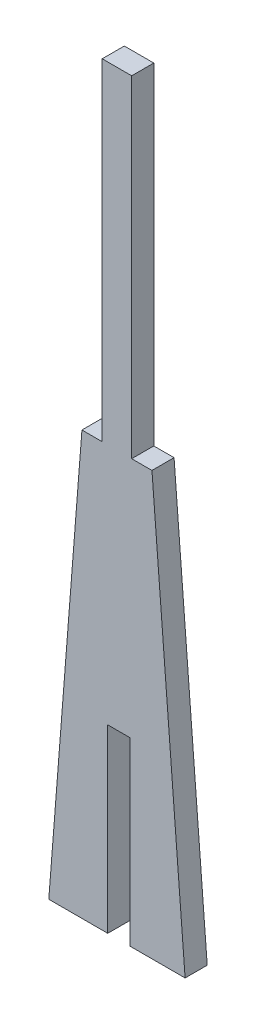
ISO-10303-21;
HEADER;
FILE_DESCRIPTION(('STEP AP214'),'2;1');
FILE_NAME('part.step','',(''),(''),'','','');
FILE_SCHEMA(('AUTOMOTIVE_DESIGN { 1 0 10303 214 1 1 1 1 }'));
ENDSEC;
DATA;
#1=APPLICATION_CONTEXT('core data for automotive mechanical design processes');
#2=APPLICATION_PROTOCOL_DEFINITION('international standard','automotive_design',2000,#1);
#3=PRODUCT_CONTEXT('',#1,'mechanical');
#4=PRODUCT('Part','Part','',(#3));
#5=PRODUCT_RELATED_PRODUCT_CATEGORY('part','',(#4));
#6=PRODUCT_DEFINITION_FORMATION('','',#4);
#7=PRODUCT_DEFINITION_CONTEXT('part definition',#1,'design');
#8=PRODUCT_DEFINITION('design','',#6,#7);
#9=PRODUCT_DEFINITION_SHAPE('','',#8);
#10=(LENGTH_UNIT() NAMED_UNIT(*) SI_UNIT(.MILLI.,.METRE.));
#11=(NAMED_UNIT(*) PLANE_ANGLE_UNIT() SI_UNIT($,.RADIAN.));
#12=(NAMED_UNIT(*) SI_UNIT($,.STERADIAN.) SOLID_ANGLE_UNIT());
#13=UNCERTAINTY_MEASURE_WITH_UNIT(LENGTH_MEASURE(1.E-05),#10,'distance_accuracy_value','');
#14=(GEOMETRIC_REPRESENTATION_CONTEXT(3) GLOBAL_UNCERTAINTY_ASSIGNED_CONTEXT((#13)) GLOBAL_UNIT_ASSIGNED_CONTEXT((#10,
#11,#12)) REPRESENTATION_CONTEXT('',''));
#15=CARTESIAN_POINT('',(0.,0.,0.));
#16=DIRECTION('',(0.,0.,1.));
#17=DIRECTION('',(1.,0.,0.));
#18=AXIS2_PLACEMENT_3D('',#15,#16,#17);
#19=CARTESIAN_POINT('',(0.,24.5,3.));
#20=DIRECTION('',(0.,1.,0.));
#21=DIRECTION('',(0.,0.,1.));
#22=AXIS2_PLACEMENT_3D('',#19,#20,#21);
#23=PLANE('',#22);
#24=DIRECTION('',(1.,0.,0.));
#25=VECTOR('',#24,1.);
#26=CARTESIAN_POINT('',(0.,24.5,0.));
#27=LINE('',#26,#25);
#28=CARTESIAN_POINT('',(-1.25,24.5,0.));
#29=VERTEX_POINT('',#28);
#30=CARTESIAN_POINT('',(1.75,24.5,0.));
#31=VERTEX_POINT('',#30);
#32=EDGE_CURVE('E163',#29,#31,#27,.T.);
#33=ORIENTED_EDGE('',*,*,#32,.T.);
#34=DIRECTION('',(0.,0.,-1.));
#35=VECTOR('',#34,1.);
#36=CARTESIAN_POINT('',(1.75,24.5,3.));
#37=LINE('',#36,#35);
#38=CARTESIAN_POINT('',(1.75,24.5,3.));
#39=VERTEX_POINT('',#38);
#40=EDGE_CURVE('E11',#39,#31,#37,.T.);
#41=ORIENTED_EDGE('',*,*,#40,.F.);
#42=DIRECTION('',(1.,0.,0.));
#43=VECTOR('',#42,1.);
#44=CARTESIAN_POINT('',(0.,24.5,3.));
#45=LINE('',#44,#43);
#46=CARTESIAN_POINT('',(-1.25,24.5,3.));
#47=VERTEX_POINT('',#46);
#48=EDGE_CURVE('E192',#47,#39,#45,.T.);
#49=ORIENTED_EDGE('',*,*,#48,.F.);
#50=DIRECTION('',(0.,0.,-1.));
#51=VECTOR('',#50,1.);
#52=CARTESIAN_POINT('',(-1.25,24.5,3.));
#53=LINE('',#52,#51);
#54=EDGE_CURVE('E59',#47,#29,#53,.T.);
#55=ORIENTED_EDGE('',*,*,#54,.T.);
#56=EDGE_LOOP('',(#33,#41,#49,#55));
#57=FACE_BOUND('',#56,.T.);
#58=ADVANCED_FACE('F43',(#57),#23,.F.);
#59=CARTESIAN_POINT('',(1.75,0.,3.));
#60=DIRECTION('',(1.,0.,0.));
#61=DIRECTION('',(0.,1.,0.));
#62=AXIS2_PLACEMENT_3D('',#59,#60,#61);
#63=PLANE('',#62);
#64=DIRECTION('',(0.,-1.,0.));
#65=VECTOR('',#64,1.);
#66=CARTESIAN_POINT('',(1.75,0.,0.));
#67=LINE('',#66,#65);
#68=CARTESIAN_POINT('',(1.75,0.,0.));
#69=VERTEX_POINT('',#68);
#70=EDGE_CURVE('E165',#31,#69,#67,.T.);
#71=ORIENTED_EDGE('',*,*,#70,.T.);
#72=DIRECTION('',(0.,0.,-1.));
#73=VECTOR('',#72,1.);
#74=CARTESIAN_POINT('',(1.75,0.,3.));
#75=LINE('',#74,#73);
#76=CARTESIAN_POINT('',(1.75,0.,3.));
#77=VERTEX_POINT('',#76);
#78=EDGE_CURVE('E51',#77,#69,#75,.T.);
#79=ORIENTED_EDGE('',*,*,#78,.F.);
#80=DIRECTION('',(0.,-1.,0.));
#81=VECTOR('',#80,1.);
#82=CARTESIAN_POINT('',(1.75,0.,3.));
#83=LINE('',#82,#81);
#84=EDGE_CURVE('E110',#39,#77,#83,.T.);
#85=ORIENTED_EDGE('',*,*,#84,.F.);
#86=ORIENTED_EDGE('',*,*,#40,.T.);
#87=EDGE_LOOP('',(#71,#79,#85,#86));
#88=FACE_BOUND('',#87,.T.);
#89=ADVANCED_FACE('F256',(#88),#63,.F.);
#90=CARTESIAN_POINT('',(0.,0.,3.));
#91=DIRECTION('',(0.,1.,0.));
#92=DIRECTION('',(0.,0.,1.));
#93=AXIS2_PLACEMENT_3D('',#90,#91,#92);
#94=PLANE('',#93);
#95=DIRECTION('',(1.,0.,0.));
#96=VECTOR('',#95,1.);
#97=CARTESIAN_POINT('',(0.,0.,0.));
#98=LINE('',#97,#96);
#99=CARTESIAN_POINT('',(9.25,0.,0.));
#100=VERTEX_POINT('',#99);
#101=EDGE_CURVE('E167',#69,#100,#98,.T.);
#102=ORIENTED_EDGE('',*,*,#101,.T.);
#103=DIRECTION('',(0.,0.,-1.));
#104=VECTOR('',#103,1.);
#105=CARTESIAN_POINT('',(9.25,0.,3.));
#106=LINE('',#105,#104);
#107=CARTESIAN_POINT('',(9.25,0.,3.));
#108=VERTEX_POINT('',#107);
#109=EDGE_CURVE('E206',#108,#100,#106,.T.);
#110=ORIENTED_EDGE('',*,*,#109,.F.);
#111=DIRECTION('',(1.,0.,0.));
#112=VECTOR('',#111,1.);
#113=CARTESIAN_POINT('',(0.,0.,3.));
#114=LINE('',#113,#112);
#115=EDGE_CURVE('E213',#77,#108,#114,.T.);
#116=ORIENTED_EDGE('',*,*,#115,.F.);
#117=ORIENTED_EDGE('',*,*,#78,.T.);
#118=EDGE_LOOP('',(#102,#110,#116,#117));
#119=FACE_BOUND('',#118,.T.);
#120=ADVANCED_FACE('F211',(#119),#94,.F.);
#121=CARTESIAN_POINT('',(9.19349564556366,0.720744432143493,3.));
#122=DIRECTION('',(0.996941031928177,0.0781573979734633,0.));
#123=DIRECTION('',(-0.0781573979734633,0.996941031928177,0.));
#124=AXIS2_PLACEMENT_3D('',#121,#122,#123);
#125=PLANE('',#124);
#126=DIRECTION('',(0.0781573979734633,-0.996941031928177,0.));
#127=VECTOR('',#126,1.);
#128=CARTESIAN_POINT('',(9.19349564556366,0.720744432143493,0.));
#129=LINE('',#128,#127);
#130=CARTESIAN_POINT('',(4.75,57.4,0.));
#131=VERTEX_POINT('',#130);
#132=EDGE_CURVE('E170',#131,#100,#129,.T.);
#133=ORIENTED_EDGE('',*,*,#132,.F.);
#134=DIRECTION('',(0.,0.,-1.));
#135=VECTOR('',#134,1.);
#136=CARTESIAN_POINT('',(4.75,57.4,3.));
#137=LINE('',#136,#135);
#138=CARTESIAN_POINT('',(4.75,57.4,3.));
#139=VERTEX_POINT('',#138);
#140=EDGE_CURVE('E204',#139,#131,#137,.T.);
#141=ORIENTED_EDGE('',*,*,#140,.F.);
#142=DIRECTION('',(0.0781573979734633,-0.996941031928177,0.));
#143=VECTOR('',#142,1.);
#144=CARTESIAN_POINT('',(9.19349564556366,0.720744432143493,3.));
#145=LINE('',#144,#143);
#146=EDGE_CURVE('E222',#139,#108,#145,.T.);
#147=ORIENTED_EDGE('',*,*,#146,.T.);
#148=ORIENTED_EDGE('',*,*,#109,.T.);
#149=EDGE_LOOP('',(#133,#141,#147,#148));
#150=FACE_BOUND('',#149,.T.);
#151=ADVANCED_FACE('F219',(#150),#125,.T.);
#152=CARTESIAN_POINT('',(0.,57.4,3.));
#153=DIRECTION('',(0.,1.,0.));
#154=DIRECTION('',(0.,0.,1.));
#155=AXIS2_PLACEMENT_3D('',#152,#153,#154);
#156=PLANE('',#155);
#157=DIRECTION('',(1.,0.,0.));
#158=VECTOR('',#157,1.);
#159=CARTESIAN_POINT('',(0.,57.4,0.));
#160=LINE('',#159,#158);
#161=CARTESIAN_POINT('',(1.99999999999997,57.4,0.));
#162=VERTEX_POINT('',#161);
#163=EDGE_CURVE('E173',#162,#131,#160,.T.);
#164=ORIENTED_EDGE('',*,*,#163,.F.);
#165=DIRECTION('',(0.,0.,-1.));
#166=VECTOR('',#165,1.);
#167=CARTESIAN_POINT('',(1.99999999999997,57.4,3.));
#168=LINE('',#167,#166);
#169=CARTESIAN_POINT('',(1.99999999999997,57.4,3.));
#170=VERTEX_POINT('',#169);
#171=EDGE_CURVE('E202',#170,#162,#168,.T.);
#172=ORIENTED_EDGE('',*,*,#171,.F.);
#173=DIRECTION('',(1.,0.,0.));
#174=VECTOR('',#173,1.);
#175=CARTESIAN_POINT('',(0.,57.4,3.));
#176=LINE('',#175,#174);
#177=EDGE_CURVE('E225',#170,#139,#176,.T.);
#178=ORIENTED_EDGE('',*,*,#177,.T.);
#179=ORIENTED_EDGE('',*,*,#140,.T.);
#180=EDGE_LOOP('',(#164,#172,#178,#179));
#181=FACE_BOUND('',#180,.T.);
#182=ADVANCED_FACE('F269',(#181),#156,.T.);
#183=CARTESIAN_POINT('',(1.99999999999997,0.,3.));
#184=DIRECTION('',(1.,0.,0.));
#185=DIRECTION('',(0.,0.,-1.));
#186=AXIS2_PLACEMENT_3D('',#183,#184,#185);
#187=PLANE('',#186);
#188=DIRECTION('',(0.,-1.,0.));
#189=VECTOR('',#188,1.);
#190=CARTESIAN_POINT('',(1.99999999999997,0.,0.));
#191=LINE('',#190,#189);
#192=CARTESIAN_POINT('',(1.99999999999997,102.4,0.));
#193=VERTEX_POINT('',#192);
#194=EDGE_CURVE('E176',#193,#162,#191,.T.);
#195=ORIENTED_EDGE('',*,*,#194,.F.);
#196=DIRECTION('',(0.,0.,-1.));
#197=VECTOR('',#196,1.);
#198=CARTESIAN_POINT('',(1.99999999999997,102.4,3.));
#199=LINE('',#198,#197);
#200=CARTESIAN_POINT('',(1.99999999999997,102.4,3.));
#201=VERTEX_POINT('',#200);
#202=EDGE_CURVE('E200',#201,#193,#199,.T.);
#203=ORIENTED_EDGE('',*,*,#202,.F.);
#204=DIRECTION('',(0.,-1.,0.));
#205=VECTOR('',#204,1.);
#206=CARTESIAN_POINT('',(1.99999999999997,0.,3.));
#207=LINE('',#206,#205);
#208=EDGE_CURVE('E227',#201,#170,#207,.T.);
#209=ORIENTED_EDGE('',*,*,#208,.T.);
#210=ORIENTED_EDGE('',*,*,#171,.T.);
#211=EDGE_LOOP('',(#195,#203,#209,#210));
#212=FACE_BOUND('',#211,.T.);
#213=ADVANCED_FACE('F270',(#212),#187,.T.);
#214=CARTESIAN_POINT('',(0.,102.4,3.));
#215=DIRECTION('',(0.,1.,0.));
#216=DIRECTION('',(0.,0.,1.));
#217=AXIS2_PLACEMENT_3D('',#214,#215,#216);
#218=PLANE('',#217);
#219=DIRECTION('',(1.,0.,0.));
#220=VECTOR('',#219,1.);
#221=CARTESIAN_POINT('',(0.,102.4,0.));
#222=LINE('',#221,#220);
#223=CARTESIAN_POINT('',(-2.00000000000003,102.4,0.));
#224=VERTEX_POINT('',#223);
#225=EDGE_CURVE('E180',#224,#193,#222,.T.);
#226=ORIENTED_EDGE('',*,*,#225,.F.);
#227=DIRECTION('',(0.,0.,-1.));
#228=VECTOR('',#227,1.);
#229=CARTESIAN_POINT('',(-2.00000000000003,102.4,3.));
#230=LINE('',#229,#228);
#231=CARTESIAN_POINT('',(-2.00000000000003,102.4,3.));
#232=VERTEX_POINT('',#231);
#233=EDGE_CURVE('E198',#232,#224,#230,.T.);
#234=ORIENTED_EDGE('',*,*,#233,.F.);
#235=DIRECTION('',(1.,0.,0.));
#236=VECTOR('',#235,1.);
#237=CARTESIAN_POINT('',(0.,102.4,3.));
#238=LINE('',#237,#236);
#239=EDGE_CURVE('E234',#232,#201,#238,.T.);
#240=ORIENTED_EDGE('',*,*,#239,.T.);
#241=ORIENTED_EDGE('',*,*,#202,.T.);
#242=EDGE_LOOP('',(#226,#234,#240,#241));
#243=FACE_BOUND('',#242,.T.);
#244=ADVANCED_FACE('F273',(#243),#218,.T.);
#245=CARTESIAN_POINT('',(-2.00000000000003,0.,3.));
#246=DIRECTION('',(1.,0.,0.));
#247=DIRECTION('',(0.,0.,-1.));
#248=AXIS2_PLACEMENT_3D('',#245,#246,#247);
#249=PLANE('',#248);
#250=DIRECTION('',(0.,-1.,0.));
#251=VECTOR('',#250,1.);
#252=CARTESIAN_POINT('',(-2.00000000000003,0.,0.));
#253=LINE('',#252,#251);
#254=CARTESIAN_POINT('',(-2.00000000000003,57.4,0.));
#255=VERTEX_POINT('',#254);
#256=EDGE_CURVE('E183',#224,#255,#253,.T.);
#257=ORIENTED_EDGE('',*,*,#256,.T.);
#258=DIRECTION('',(0.,0.,-1.));
#259=VECTOR('',#258,1.);
#260=CARTESIAN_POINT('',(-2.00000000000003,57.4,3.));
#261=LINE('',#260,#259);
#262=CARTESIAN_POINT('',(-2.00000000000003,57.4,3.));
#263=VERTEX_POINT('',#262);
#264=EDGE_CURVE('E196',#263,#255,#261,.T.);
#265=ORIENTED_EDGE('',*,*,#264,.F.);
#266=DIRECTION('',(0.,-1.,0.));
#267=VECTOR('',#266,1.);
#268=CARTESIAN_POINT('',(-2.00000000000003,0.,3.));
#269=LINE('',#268,#267);
#270=EDGE_CURVE('E236',#232,#263,#269,.T.);
#271=ORIENTED_EDGE('',*,*,#270,.F.);
#272=ORIENTED_EDGE('',*,*,#233,.T.);
#273=EDGE_LOOP('',(#257,#265,#271,#272));
#274=FACE_BOUND('',#273,.T.);
#275=ADVANCED_FACE('F277',(#274),#249,.F.);
#276=CARTESIAN_POINT('',(-4.75,57.4,0.));
#277=VERTEX_POINT('',#276);
#278=EDGE_CURVE('E177',#277,#255,#160,.T.);
#279=ORIENTED_EDGE('',*,*,#278,.F.);
#280=DIRECTION('',(0.,0.,-1.));
#281=VECTOR('',#280,1.);
#282=CARTESIAN_POINT('',(-4.75,57.4,3.));
#283=LINE('',#282,#281);
#284=CARTESIAN_POINT('',(-4.75,57.4,3.));
#285=VERTEX_POINT('',#284);
#286=EDGE_CURVE('E155',#285,#277,#283,.T.);
#287=ORIENTED_EDGE('',*,*,#286,.F.);
#288=EDGE_CURVE('E145',#285,#263,#176,.T.);
#289=ORIENTED_EDGE('',*,*,#288,.T.);
#290=ORIENTED_EDGE('',*,*,#264,.T.);
#291=EDGE_LOOP('',(#279,#287,#289,#290));
#292=FACE_BOUND('',#291,.T.);
#293=ADVANCED_FACE('F242',(#292),#156,.T.);
#294=CARTESIAN_POINT('',(-9.19349564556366,0.720744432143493,3.));
#295=DIRECTION('',(0.996941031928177,-0.0781573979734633,0.));
#296=DIRECTION('',(0.0781573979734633,0.996941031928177,0.));
#297=AXIS2_PLACEMENT_3D('',#294,#295,#296);
#298=PLANE('',#297);
#299=DIRECTION('',(-0.0781573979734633,-0.996941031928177,0.));
#300=VECTOR('',#299,1.);
#301=CARTESIAN_POINT('',(-9.19349564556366,0.720744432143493,0.));
#302=LINE('',#301,#300);
#303=CARTESIAN_POINT('',(-9.25,0.,0.));
#304=VERTEX_POINT('',#303);
#305=EDGE_CURVE('E152',#277,#304,#302,.T.);
#306=ORIENTED_EDGE('',*,*,#305,.T.);
#307=DIRECTION('',(0.,0.,-1.));
#308=VECTOR('',#307,1.);
#309=CARTESIAN_POINT('',(-9.25,0.,3.));
#310=LINE('',#309,#308);
#311=CARTESIAN_POINT('',(-9.25,0.,3.));
#312=VERTEX_POINT('',#311);
#313=EDGE_CURVE('E149',#312,#304,#310,.T.);
#314=ORIENTED_EDGE('',*,*,#313,.F.);
#315=DIRECTION('',(-0.0781573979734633,-0.996941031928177,0.));
#316=VECTOR('',#315,1.);
#317=CARTESIAN_POINT('',(-9.19349564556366,0.720744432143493,3.));
#318=LINE('',#317,#316);
#319=EDGE_CURVE('E138',#285,#312,#318,.T.);
#320=ORIENTED_EDGE('',*,*,#319,.F.);
#321=ORIENTED_EDGE('',*,*,#286,.T.);
#322=EDGE_LOOP('',(#306,#314,#320,#321));
#323=FACE_BOUND('',#322,.T.);
#324=ADVANCED_FACE('F150',(#323),#298,.F.);
#325=CARTESIAN_POINT('',(0.,0.,3.));
#326=DIRECTION('',(0.,1.,0.));
#327=DIRECTION('',(-1.,0.,0.));
#328=AXIS2_PLACEMENT_3D('',#325,#326,#327);
#329=PLANE('',#328);
#330=DIRECTION('',(1.,0.,0.));
#331=VECTOR('',#330,1.);
#332=CARTESIAN_POINT('',(0.,0.,0.));
#333=LINE('',#332,#331);
#334=CARTESIAN_POINT('',(-1.25,0.,0.));
#335=VERTEX_POINT('',#334);
#336=EDGE_CURVE('E187',#304,#335,#333,.T.);
#337=ORIENTED_EDGE('',*,*,#336,.T.);
#338=DIRECTION('',(0.,0.,-1.));
#339=VECTOR('',#338,1.);
#340=CARTESIAN_POINT('',(-1.25,0.,3.));
#341=LINE('',#340,#339);
#342=CARTESIAN_POINT('',(-1.25,0.,3.));
#343=VERTEX_POINT('',#342);
#344=EDGE_CURVE('E98',#343,#335,#341,.T.);
#345=ORIENTED_EDGE('',*,*,#344,.F.);
#346=DIRECTION('',(1.,0.,0.));
#347=VECTOR('',#346,1.);
#348=CARTESIAN_POINT('',(0.,0.,3.));
#349=LINE('',#348,#347);
#350=EDGE_CURVE('E143',#312,#343,#349,.T.);
#351=ORIENTED_EDGE('',*,*,#350,.F.);
#352=ORIENTED_EDGE('',*,*,#313,.T.);
#353=EDGE_LOOP('',(#337,#345,#351,#352));
#354=FACE_BOUND('',#353,.T.);
#355=ADVANCED_FACE('F157',(#354),#329,.F.);
#356=CARTESIAN_POINT('',(-1.25,0.,3.));
#357=DIRECTION('',(1.,0.,0.));
#358=DIRECTION('',(0.,1.,0.));
#359=AXIS2_PLACEMENT_3D('',#356,#357,#358);
#360=PLANE('',#359);
#361=DIRECTION('',(0.,-1.,0.));
#362=VECTOR('',#361,1.);
#363=CARTESIAN_POINT('',(-1.25,0.,0.));
#364=LINE('',#363,#362);
#365=EDGE_CURVE('E189',#29,#335,#364,.T.);
#366=ORIENTED_EDGE('',*,*,#365,.F.);
#367=ORIENTED_EDGE('',*,*,#54,.F.);
#368=DIRECTION('',(0.,-1.,0.));
#369=VECTOR('',#368,1.);
#370=CARTESIAN_POINT('',(-1.25,0.,3.));
#371=LINE('',#370,#369);
#372=EDGE_CURVE('E158',#47,#343,#371,.T.);
#373=ORIENTED_EDGE('',*,*,#372,.T.);
#374=ORIENTED_EDGE('',*,*,#344,.T.);
#375=EDGE_LOOP('',(#366,#367,#373,#374));
#376=FACE_BOUND('',#375,.T.);
#377=ADVANCED_FACE('F245',(#376),#360,.T.);
#378=CARTESIAN_POINT('',(0.,0.,3.));
#379=DIRECTION('',(0.,0.,1.));
#380=DIRECTION('',(1.,0.,0.));
#381=AXIS2_PLACEMENT_3D('',#378,#379,#380);
#382=PLANE('',#381);
#383=ORIENTED_EDGE('',*,*,#48,.T.);
#384=ORIENTED_EDGE('',*,*,#84,.T.);
#385=ORIENTED_EDGE('',*,*,#115,.T.);
#386=ORIENTED_EDGE('',*,*,#146,.F.);
#387=ORIENTED_EDGE('',*,*,#177,.F.);
#388=ORIENTED_EDGE('',*,*,#208,.F.);
#389=ORIENTED_EDGE('',*,*,#239,.F.);
#390=ORIENTED_EDGE('',*,*,#270,.T.);
#391=ORIENTED_EDGE('',*,*,#288,.F.);
#392=ORIENTED_EDGE('',*,*,#319,.T.);
#393=ORIENTED_EDGE('',*,*,#350,.T.);
#394=ORIENTED_EDGE('',*,*,#372,.F.);
#395=EDGE_LOOP('',(#383,#384,#385,#386,#387,#388,#389,#390,#391,#392,#393,#394));
#396=FACE_BOUND('',#395,.T.);
#397=ADVANCED_FACE('F140',(#396),#382,.T.);
#398=CARTESIAN_POINT('',(0.,0.,0.));
#399=DIRECTION('',(0.,0.,1.));
#400=DIRECTION('',(1.,0.,0.));
#401=AXIS2_PLACEMENT_3D('',#398,#399,#400);
#402=PLANE('',#401);
#403=ORIENTED_EDGE('',*,*,#32,.F.);
#404=ORIENTED_EDGE('',*,*,#365,.T.);
#405=ORIENTED_EDGE('',*,*,#336,.F.);
#406=ORIENTED_EDGE('',*,*,#305,.F.);
#407=ORIENTED_EDGE('',*,*,#278,.T.);
#408=ORIENTED_EDGE('',*,*,#256,.F.);
#409=ORIENTED_EDGE('',*,*,#225,.T.);
#410=ORIENTED_EDGE('',*,*,#194,.T.);
#411=ORIENTED_EDGE('',*,*,#163,.T.);
#412=ORIENTED_EDGE('',*,*,#132,.T.);
#413=ORIENTED_EDGE('',*,*,#101,.F.);
#414=ORIENTED_EDGE('',*,*,#70,.F.);
#415=EDGE_LOOP('',(#403,#404,#405,#406,#407,#408,#409,#410,#411,#412,#413,#414));
#416=FACE_BOUND('',#415,.T.);
#417=ADVANCED_FACE('F215',(#416),#402,.F.);
#418=CLOSED_SHELL('',(#58,#89,#120,#151,#182,#213,#244,#275,#293,#324,#355,#377,#397,#417));
#419=MANIFOLD_SOLID_BREP('B2',#418);
#420=ADVANCED_BREP_SHAPE_REPRESENTATION('',(#18,#419),#14);
#421=SHAPE_DEFINITION_REPRESENTATION(#9,#420);
ENDSEC;
END-ISO-10303-21;
